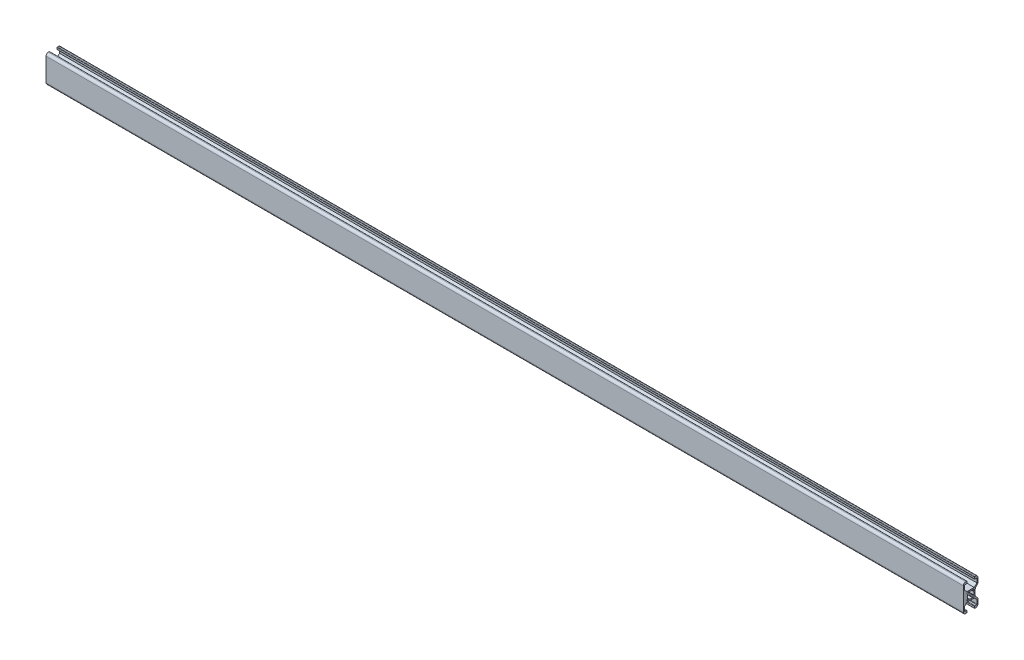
from build123d import *

# Parameters (mm, degrees)
F_30_SARJA_1_0002_16X30_1_DEPTH = 1000


with BuildPart() as part:
    # Model → 30-sarja 1.0002 16X30_1 (new body)
    with BuildSketch(Plane(origin=(0, 0, 0), x_dir=(0, 0, -1), z_dir=(1, 0, 0))):
        with BuildLine():
            Line((6.799997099, -7.860659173), (6.799997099, -12.200008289))
            ThreePointArc((6.799997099, -12.200008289), (6.712128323, -12.412133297), (6.500001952, -12.49999878))
            Line((6.500001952, -12.49999878), (4.599999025, -12.49999878))
            ThreePointArc((4.599999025, -12.49999878), (4.246445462, -12.646445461), (4.099998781, -12.999999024))
            Line((4.099998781, -12.999999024), (4.099998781, -14.699999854))
            ThreePointArc((4.099998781, -14.699999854), (4.187865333, -14.912130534), (4.399994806, -15))
            Line((4.399994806, -15), (5.499996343, -15))
            ThreePointArc((5.499996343, -15), (7.267760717, -14.267768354), (7.999995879, -12.500005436))
            Line((7.999995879, -12.500005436), (7.999995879, -7.974877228))
            ThreePointArc((7.999995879, -7.974877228), (7.809694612, -7.018168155), (7.267762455, -6.207109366))
            Line((7.267762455, -6.207109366), (5.732227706, -4.671574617))
            ThreePointArc((5.732227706, -4.671574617), (5.190296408, -3.860515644), (4.999995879, -2.903806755))
            Line((4.999995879, -2.903806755), (4.999995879, 2.903808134))
            ThreePointArc((4.999995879, 2.903808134), (5.190295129, 3.860520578), (5.732227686, 4.671582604))
            Line((5.732227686, 4.671582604), (7.267762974, 6.207117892))
            ThreePointArc((7.267762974, 6.207117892), (7.809694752, 7.018176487), (7.999995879, 7.974885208))
            Line((7.999995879, 7.974885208), (7.999995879, 12.500013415))
            ThreePointArc((7.999995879, 12.500013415), (7.267757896, 14.267771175), (5.499996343, 15))
            Line((5.499996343, 15), (4.399994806, 15))
            ThreePointArc((4.399994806, 15), (4.187865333, 14.912130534), (4.099998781, 14.699999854))
            Line((4.099998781, 14.699999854), (4.099998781, 12.999999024))
            ThreePointArc((4.099998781, 12.999999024), (4.246445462, 12.646445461), (4.599999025, 12.49999878))
            Line((4.599999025, 12.49999878), (6.499999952, 12.49999878))
            ThreePointArc((6.499999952, 12.49999878), (6.712132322, 12.412129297), (6.799997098, 12.199994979))
            Line((6.799997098, 12.199994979), (6.799997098, 7.860644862))
            Line((6.799997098, 7.860644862), (3.939340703, 4.999988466))
            Line((3.939340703, 4.999988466), (-3.939343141, 4.999988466))
            Line((-3.939343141, 4.999988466), (-6.799999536, 7.860644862))
            Line((-6.799999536, 7.860644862), (-6.799999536, 12.199994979))
            ThreePointArc((-6.799999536, 12.199994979), (-6.712132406, 12.412124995), (-6.50000239, 12.499992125))
            Line((-6.50000239, 12.499992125), (-4.600001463, 12.499992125))
            ThreePointArc((-4.600001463, 12.499992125), (-4.2464479, 12.646438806), (-4.100001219, 12.999992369))
            Line((-4.100001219, 12.999992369), (-4.100001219, 14.699993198))
            ThreePointArc((-4.100001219, 14.699993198), (-4.187869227, 14.912125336), (-4.400001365, 14.999993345))
            Line((-4.400001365, 14.999993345), (-5.500002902, 14.999993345))
            ThreePointArc((-5.500002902, 14.999993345), (-7.267765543, 14.267765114), (-8.000004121, 12.50000676))
            Line((-8.000004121, 12.50000676), (-8.000004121, -12.500005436))
            ThreePointArc((-8.000004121, -12.500005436), (-7.267770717, -14.267773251), (-5.500002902, -15.000006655))
            Line((-5.500002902, -15.000006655), (-4.400001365, -15.000006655))
            ThreePointArc((-4.400001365, -15.000006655), (-4.187869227, -14.912138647), (-4.100001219, -14.700006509))
            Line((-4.100001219, -14.700006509), (-4.100001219, -13.00000568))
            ThreePointArc((-4.100001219, -13.00000568), (-4.2464479, -12.646452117), (-4.600001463, -12.500005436))
            Line((-4.600001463, -12.500005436), (-6.500002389, -12.500005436))
            ThreePointArc((-6.500002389, -12.500005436), (-6.712132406, -12.412138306), (-6.799999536, -12.200008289))
            Line((-6.799999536, -12.200008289), (-6.799999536, -7.860659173))
            Line((-6.799999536, -7.860659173), (-3.93934314, -5.000001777))
            Line((-3.93934314, -5.000001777), (3.939340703, -5.000001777))
            Line((3.939340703, -5.000001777), (6.799997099, -7.860659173))
        make_face()
        with BuildLine():
            Line((-2.243070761, 3.657296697), (-3.28587427, 3.878895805))
            ThreePointArc((-3.28587427, 3.878895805), (-3.743359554, 3.743370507), (-3.878885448, 3.2858854))
            Line((-3.878885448, 3.2858854), (-3.657285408, 2.24308221))
            Line((-3.657285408, 2.24308221), (-3.363289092, 1.949085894))
            ThreePointArc((-3.363289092, 1.949085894), (-3.279574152, 1.78669905), (-3.305577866, 1.605863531))
            ThreePointArc((-3.305577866, 1.605863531), (-3.67500241, 6.42e-06), (-3.305583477, -1.605851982))
            ThreePointArc((-3.305583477, -1.605851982), (-3.279579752, -1.786687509), (-3.363294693, -1.949074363))
            Line((-3.363294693, -1.949074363), (-3.657290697, -2.243070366))
            Line((-3.657290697, -2.243070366), (-3.878890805, -3.285873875))
            ThreePointArc((-3.878890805, -3.285873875), (-3.743365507, -3.743359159), (-3.2858804, -3.878885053))
            Line((-3.2858804, -3.878885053), (-2.243076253, -3.657284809))
            Line((-2.243076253, -3.657284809), (-1.949080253, -3.363288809))
            ThreePointArc((-1.949080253, -3.363288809), (-1.786693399, -3.279573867), (-1.605857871, -3.305577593))
            ThreePointArc((-1.605857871, -3.305577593), (1.427e-06, -3.67499969), (1.605860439, -3.305576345))
            ThreePointArc((1.605860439, -3.305576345), (1.786695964, -3.279572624), (1.949082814, -3.363287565))
            Line((1.949082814, -3.363287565), (2.243079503, -3.657284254))
            Line((2.243079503, -3.657284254), (3.285883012, -3.878884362))
            ThreePointArc((3.285883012, -3.878884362), (3.743367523, -3.743358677), (3.878893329, -3.285874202))
            Line((3.878893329, -3.285874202), (3.65729399, -2.243069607))
            Line((3.65729399, -2.243069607), (3.363297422, -1.949074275))
            ThreePointArc((3.363297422, -1.949074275), (3.279582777, -1.786686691), (3.305587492, -1.605850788))
            ThreePointArc((3.305587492, -1.605850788), (3.6750055, 6.222e-06), (3.305582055, 1.605861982))
            ThreePointArc((3.305582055, 1.605861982), (3.279579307, 1.786697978), (3.363295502, 1.949084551))
            Line((3.363295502, 1.949084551), (3.657291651, 2.243079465))
            Line((3.657291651, 2.243079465), (3.878890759, 3.285882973))
            ThreePointArc((3.878890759, 3.285882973), (3.743365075, 3.743367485), (3.2858806, 3.87889329))
            Line((3.2858806, 3.87889329), (2.243076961, 3.657294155))
            Line((2.243076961, 3.657294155), (1.94908177, 3.363297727))
            ThreePointArc((1.94908177, 3.363297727), (1.786694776, 3.279582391), (1.605858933, 3.30558607))
            ThreePointArc((1.605858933, 3.30558607), (3.304e-06, 3.675007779), (-1.60585299, 3.305588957))
            ThreePointArc((-1.60585299, 3.305588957), (-1.78668886, 3.279585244), (-1.949075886, 3.363300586))
            Line((-1.949075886, 3.363300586), (-2.243070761, 3.657296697))
        make_face(mode=Mode.SUBTRACT)
    extrude(amount=F_30_SARJA_1_0002_16X30_1_DEPTH)


solid = part.part
